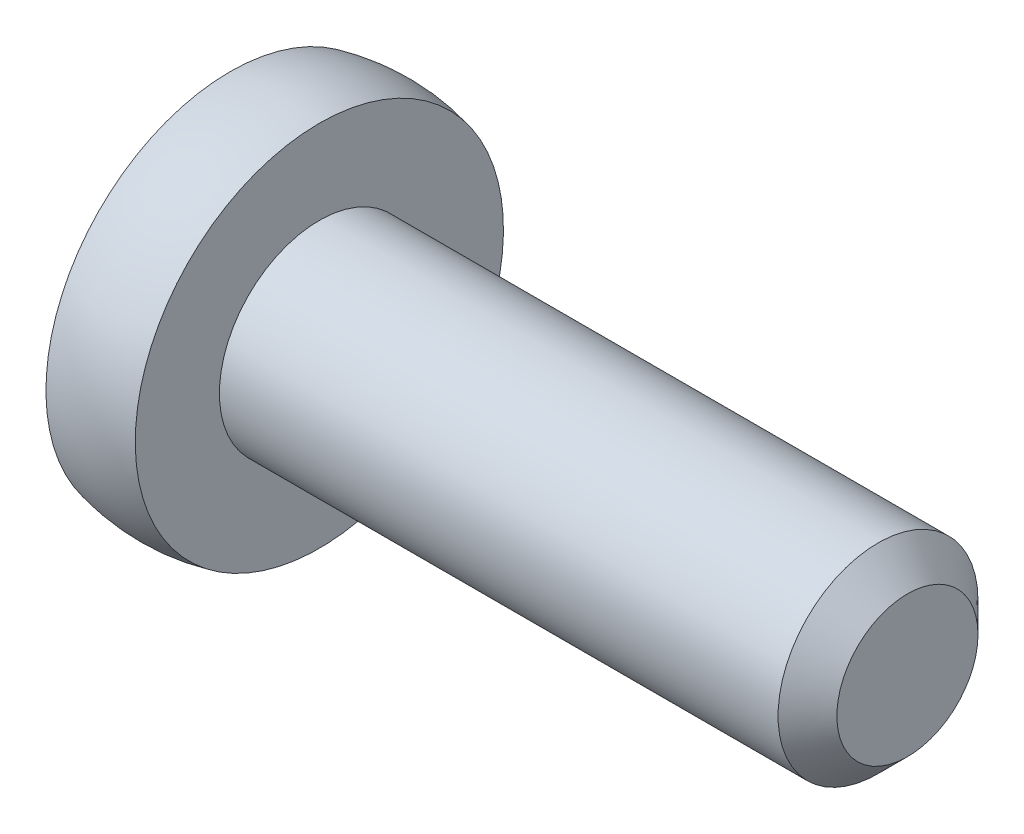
from build123d import *

# Parameters (mm, degrees)
EXTRUDE3_START = -1.016
EXTRUDE3_DEPTH = 1.905
EXTRUDE3_TAPER = 11
SKETCH6_R      = 2.159
EXTRUDE4_DEPTH = 12.7
CHAMFER1_SIZE  = 0.635


with BuildPart() as part:
    # Sketch1 → Revolve1 (revolve)
    with BuildSketch(Plane.XY):
        with BuildLine():
            Line((2.205747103, 0), (2.205747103, 3.975875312))
            ThreePointArc((2.205747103, 3.975875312), (1.241484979, 4.091135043), (0.277222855, 3.975875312))
            ThreePointArc((0.277222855, 3.975875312), (-0.557046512, 2.065236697), (-0.842252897, 0))
            Line((-0.842252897, 0), (2.205747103, 0))
        make_face()
    revolve(axis=Axis((9.077037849, 0, 0), (-1, 0, 0)))

    # Sketch2 → Extrude3 (cut)
    with BuildSketch(Plane(origin=(0, 0, 0), x_dir=(0, 0, -1), z_dir=(1, 0, 0)).offset(EXTRUDE3_START)):
        Polygon((-2.54, 0.508), (-2.54, -0.508), (-1.016, -0.508), (-0.508, -0.508), (-0.508, -1.016), (-0.508, -2.54), (0.508, -2.54), (0.508, -1.016), (0.508, -0.508), (1.016, -0.508), (2.54, -0.508), (2.54, 0.508), (1.016, 0.508), (0.508, 0.508), (0.508, 1.016), (0.508, 2.54), (-0.508, 2.54), (-0.508, 1.016), (-0.508, 0.508), (-1.016, 0.508), align=None)
    extrude(amount=EXTRUDE3_DEPTH, taper=EXTRUDE3_TAPER, mode=Mode.SUBTRACT)

    # Sketch6 → Extrude4 (add)
    with BuildSketch(Plane(origin=(2.205747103, 0, 0), x_dir=(0, 0, -1), z_dir=(1, 0, 0))):
        Circle(SKETCH6_R)
    extrude(amount=EXTRUDE4_DEPTH)

    # Chamfer1
    chamfer1_edges = [part.edges().sort_by_distance(p)[0] for p in [
        (14.905747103, 0, 2.159),
    ]]
    chamfer(chamfer1_edges, length=CHAMFER1_SIZE)


solid = part.part
